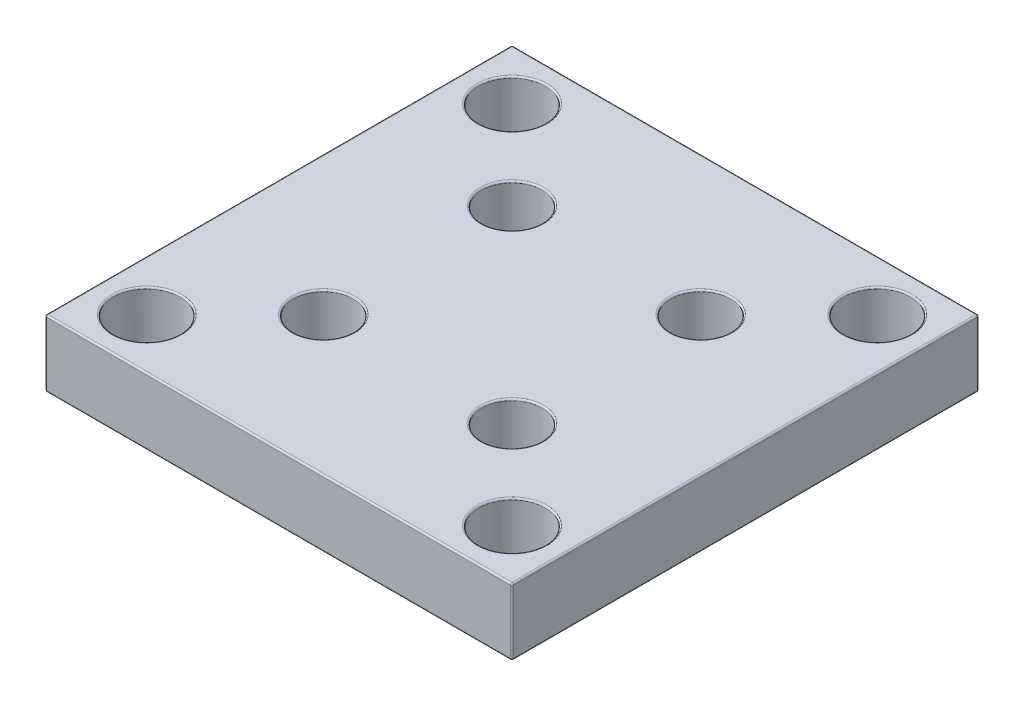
from build123d import *

# Parameters (mm, degrees)
SKETCH1_W           = 140
SKETCH1_H           = 140
BOSS_EXTRUDE1_DEPTH = 20
SKETCH2_R           = 5.5
SKETCH2_R_2         = 6.75
CUT_EXTRUDE1_DEPTH  = 199.997487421
SKETCH3_R           = 10
SKETCH3_R_2         = 9
CUT_EXTRUDE2_DEPTH  = 15
FILLET1_R           = 0.5


with BuildPart() as part:
    # Sketch1 → Boss-Extrude1 (new body)
    with BuildSketch(Plane(origin=(0, 0, 0), x_dir=(1, 0, 0), z_dir=(0, 1, 0))):
        with Locations((70, 70)):
            Rectangle(SKETCH1_W, SKETCH1_H)
    extrude(amount=BOSS_EXTRUDE1_DEPTH)

    # Sketch2 → Cut-Extrude1 (cut, through all)
    with BuildSketch(Plane(origin=(0, 20, 0), x_dir=(-1, 0, 0), z_dir=(0, 1, 0))):
        with Locations(Location((-41.715728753, -98.284271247, 0), (0, 0, 90))):
            Circle(SKETCH2_R)
        with Locations(Location((-15.25, -124.75, 0), (0, 0, 90))):
            Circle(SKETCH2_R_2)
        with Locations(Location((-98.284271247, -98.284271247, 0), (0, 0, 270))):
            Circle(SKETCH2_R)
        with Locations(Location((-124.75, -124.75, 0), (0, 0, 270))):
            Circle(SKETCH2_R_2)
        with Locations(Location((-124.75, -15.25, 0), (0, 0, 90))):
            Circle(SKETCH2_R_2)
        with Locations(Location((-98.284271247, -41.715728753, 0), (0, 0, 90))):
            Circle(SKETCH2_R)
        with Locations(Location((-41.715728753, -41.715728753, 0), (0, 0, 270))):
            Circle(SKETCH2_R)
        with Locations(Location((-15.25, -15.25, 0), (0, 0, 270))):
            Circle(SKETCH2_R_2)
    extrude(amount=-CUT_EXTRUDE1_DEPTH, mode=Mode.SUBTRACT)

    # Sketch3 → Cut-Extrude2 (cut)
    with BuildSketch(Plane(origin=(0, 20, 0), x_dir=(-1, 0, 0), z_dir=(0, 1, 0))):
        with Locations(Location((-15.25, -124.75, 0), (0, 0, 90))):
            Circle(SKETCH3_R)
        with Locations(Location((-15.25, -15.25, 0), (0, 0, 90))):
            Circle(SKETCH3_R)
        with Locations(Location((-124.75, -15.25, 0), (0, 0, 90))):
            Circle(SKETCH3_R)
        with Locations(Location((-124.75, -124.75, 0), (0, 0, 90))):
            Circle(SKETCH3_R)
        with Locations(Location((-41.715728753, -98.284271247, 0), (0, 0, 90))):
            Circle(SKETCH3_R_2)
        with Locations(Location((-98.284271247, -98.284271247, 0), (0, 0, 90))):
            Circle(SKETCH3_R_2)
        with Locations(Location((-98.284271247, -41.715728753, 0), (0, 0, 90))):
            Circle(SKETCH3_R_2)
        with Locations(Location((-41.715728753, -41.715728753, 0), (0, 0, 90))):
            Circle(SKETCH3_R_2)
    extrude(amount=-CUT_EXTRUDE2_DEPTH, mode=Mode.SUBTRACT)

    # Fillet1
    fillet1_edges = [part.edges().sort_by_distance(p)[0] for p in [
        (140, 20, -70),
        (70, 20, -140),
        (98.284271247, 0, -92.784271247),
        (41.715728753, 0, -103.784271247),
        (15.25, 0, -131.5),
        (124.75, 0, -118),
        (124.75, 0, -22),
        (98.284271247, 0, -47.215728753),
        (41.715728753, 0, -36.215728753),
        (0, 20, -70),
        (15.25, 0, -8.5),
        (70, 0, -140),
        (140, 0, -70),
        (15.25, 20, -134.75),
        (70, 0, 0),
        (15.25, 20, -25.25),
        (0, 0, -70),
        (124.75, 20, -25.25),
        (124.75, 20, -134.75),
        (41.715728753, 20, -107.284271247),
        (70, 20, 0),
        (0, 10, -140),
        (98.284271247, 20, -107.284271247),
        (140, 10, -140),
        (140, 10, 0),
        (0, 10, 0),
        (98.284271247, 20, -50.715728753),
        (41.715728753, 20, -50.715728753),
    ]]
    fillet(fillet1_edges, radius=FILLET1_R)


solid = part.part
